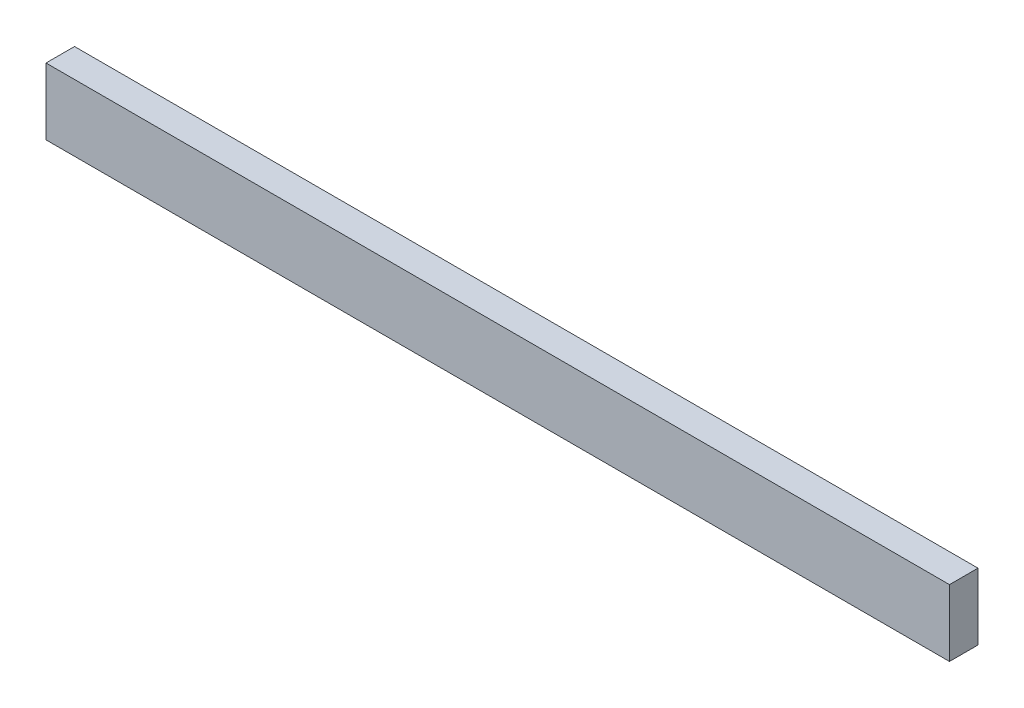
ISO-10303-21;
HEADER;
FILE_DESCRIPTION(('STEP AP214'),'2;1');
FILE_NAME('part.step','',(''),(''),'','','');
FILE_SCHEMA(('AUTOMOTIVE_DESIGN { 1 0 10303 214 1 1 1 1 }'));
ENDSEC;
DATA;
#1=APPLICATION_CONTEXT('core data for automotive mechanical design processes');
#2=APPLICATION_PROTOCOL_DEFINITION('international standard','automotive_design',2000,#1);
#3=PRODUCT_CONTEXT('',#1,'mechanical');
#4=PRODUCT('Part','Part','',(#3));
#5=PRODUCT_RELATED_PRODUCT_CATEGORY('part','',(#4));
#6=PRODUCT_DEFINITION_FORMATION('','',#4);
#7=PRODUCT_DEFINITION_CONTEXT('part definition',#1,'design');
#8=PRODUCT_DEFINITION('design','',#6,#7);
#9=PRODUCT_DEFINITION_SHAPE('','',#8);
#10=(LENGTH_UNIT() NAMED_UNIT(*) SI_UNIT(.MILLI.,.METRE.));
#11=(NAMED_UNIT(*) PLANE_ANGLE_UNIT() SI_UNIT($,.RADIAN.));
#12=(NAMED_UNIT(*) SI_UNIT($,.STERADIAN.) SOLID_ANGLE_UNIT());
#13=UNCERTAINTY_MEASURE_WITH_UNIT(LENGTH_MEASURE(1.E-05),#10,'distance_accuracy_value','');
#14=(GEOMETRIC_REPRESENTATION_CONTEXT(3) GLOBAL_UNCERTAINTY_ASSIGNED_CONTEXT((#13)) GLOBAL_UNIT_ASSIGNED_CONTEXT((#10,
#11,#12)) REPRESENTATION_CONTEXT('',''));
#15=CARTESIAN_POINT('',(0.,0.,0.));
#16=DIRECTION('',(0.,0.,1.));
#17=DIRECTION('',(1.,0.,0.));
#18=AXIS2_PLACEMENT_3D('',#15,#16,#17);
#19=CARTESIAN_POINT('',(0.,0.,6.));
#20=DIRECTION('',(1.,0.,0.));
#21=DIRECTION('',(0.,0.,-1.));
#22=AXIS2_PLACEMENT_3D('',#19,#20,#21);
#23=PLANE('',#22);
#24=DIRECTION('',(0.,-1.,0.));
#25=VECTOR('',#24,1.);
#26=CARTESIAN_POINT('',(0.,0.,0.));
#27=LINE('',#26,#25);
#28=CARTESIAN_POINT('',(0.,14.,0.));
#29=VERTEX_POINT('',#28);
#30=CARTESIAN_POINT('',(0.,0.,0.));
#31=VERTEX_POINT('',#30);
#32=EDGE_CURVE('E99',#29,#31,#27,.T.);
#33=ORIENTED_EDGE('',*,*,#32,.T.);
#34=DIRECTION('',(0.,0.,-1.));
#35=VECTOR('',#34,1.);
#36=CARTESIAN_POINT('',(0.,0.,6.));
#37=LINE('',#36,#35);
#38=CARTESIAN_POINT('',(0.,0.,6.));
#39=VERTEX_POINT('',#38);
#40=EDGE_CURVE('E11',#39,#31,#37,.T.);
#41=ORIENTED_EDGE('',*,*,#40,.F.);
#42=DIRECTION('',(0.,-1.,0.));
#43=VECTOR('',#42,1.);
#44=CARTESIAN_POINT('',(0.,0.,6.));
#45=LINE('',#44,#43);
#46=CARTESIAN_POINT('',(0.,14.,6.));
#47=VERTEX_POINT('',#46);
#48=EDGE_CURVE('E87',#47,#39,#45,.T.);
#49=ORIENTED_EDGE('',*,*,#48,.F.);
#50=DIRECTION('',(0.,0.,-1.));
#51=VECTOR('',#50,1.);
#52=CARTESIAN_POINT('',(0.,14.,6.));
#53=LINE('',#52,#51);
#54=EDGE_CURVE('E95',#47,#29,#53,.T.);
#55=ORIENTED_EDGE('',*,*,#54,.T.);
#56=EDGE_LOOP('',(#33,#41,#49,#55));
#57=FACE_BOUND('',#56,.T.);
#58=ADVANCED_FACE('F36',(#57),#23,.F.);
#59=CARTESIAN_POINT('',(0.,0.,6.));
#60=DIRECTION('',(0.,1.,0.));
#61=DIRECTION('',(0.,0.,1.));
#62=AXIS2_PLACEMENT_3D('',#59,#60,#61);
#63=PLANE('',#62);
#64=DIRECTION('',(1.,0.,0.));
#65=VECTOR('',#64,1.);
#66=CARTESIAN_POINT('',(0.,0.,0.));
#67=LINE('',#66,#65);
#68=CARTESIAN_POINT('',(190.,0.,0.));
#69=VERTEX_POINT('',#68);
#70=EDGE_CURVE('E91',#31,#69,#67,.T.);
#71=ORIENTED_EDGE('',*,*,#70,.T.);
#72=DIRECTION('',(0.,0.,-1.));
#73=VECTOR('',#72,1.);
#74=CARTESIAN_POINT('',(190.,0.,6.));
#75=LINE('',#74,#73);
#76=CARTESIAN_POINT('',(190.,0.,6.));
#77=VERTEX_POINT('',#76);
#78=EDGE_CURVE('E44',#77,#69,#75,.T.);
#79=ORIENTED_EDGE('',*,*,#78,.F.);
#80=DIRECTION('',(1.,0.,0.));
#81=VECTOR('',#80,1.);
#82=CARTESIAN_POINT('',(0.,0.,6.));
#83=LINE('',#82,#81);
#84=EDGE_CURVE('E82',#39,#77,#83,.T.);
#85=ORIENTED_EDGE('',*,*,#84,.F.);
#86=ORIENTED_EDGE('',*,*,#40,.T.);
#87=EDGE_LOOP('',(#71,#79,#85,#86));
#88=FACE_BOUND('',#87,.T.);
#89=ADVANCED_FACE('F90',(#88),#63,.F.);
#90=CARTESIAN_POINT('',(190.,0.,6.));
#91=DIRECTION('',(-1.,0.,0.));
#92=DIRECTION('',(0.,0.,1.));
#93=AXIS2_PLACEMENT_3D('',#90,#91,#92);
#94=PLANE('',#93);
#95=DIRECTION('',(0.,1.,0.));
#96=VECTOR('',#95,1.);
#97=CARTESIAN_POINT('',(190.,0.,0.));
#98=LINE('',#97,#96);
#99=CARTESIAN_POINT('',(190.,14.,0.));
#100=VERTEX_POINT('',#99);
#101=EDGE_CURVE('E69',#69,#100,#98,.T.);
#102=ORIENTED_EDGE('',*,*,#101,.T.);
#103=DIRECTION('',(0.,0.,-1.));
#104=VECTOR('',#103,1.);
#105=CARTESIAN_POINT('',(190.,14.,6.));
#106=LINE('',#105,#104);
#107=CARTESIAN_POINT('',(190.,14.,6.));
#108=VERTEX_POINT('',#107);
#109=EDGE_CURVE('E92',#108,#100,#106,.T.);
#110=ORIENTED_EDGE('',*,*,#109,.F.);
#111=DIRECTION('',(0.,1.,0.));
#112=VECTOR('',#111,1.);
#113=CARTESIAN_POINT('',(190.,0.,6.));
#114=LINE('',#113,#112);
#115=EDGE_CURVE('E85',#77,#108,#114,.T.);
#116=ORIENTED_EDGE('',*,*,#115,.F.);
#117=ORIENTED_EDGE('',*,*,#78,.T.);
#118=EDGE_LOOP('',(#102,#110,#116,#117));
#119=FACE_BOUND('',#118,.T.);
#120=ADVANCED_FACE('F93',(#119),#94,.F.);
#121=CARTESIAN_POINT('',(0.,14.,6.));
#122=DIRECTION('',(0.,-1.,0.));
#123=DIRECTION('',(0.,0.,-1.));
#124=AXIS2_PLACEMENT_3D('',#121,#122,#123);
#125=PLANE('',#124);
#126=DIRECTION('',(-1.,0.,0.));
#127=VECTOR('',#126,1.);
#128=CARTESIAN_POINT('',(0.,14.,0.));
#129=LINE('',#128,#127);
#130=EDGE_CURVE('E75',#100,#29,#129,.T.);
#131=ORIENTED_EDGE('',*,*,#130,.T.);
#132=ORIENTED_EDGE('',*,*,#54,.F.);
#133=DIRECTION('',(-1.,0.,0.));
#134=VECTOR('',#133,1.);
#135=CARTESIAN_POINT('',(0.,14.,6.));
#136=LINE('',#135,#134);
#137=EDGE_CURVE('E52',#108,#47,#136,.T.);
#138=ORIENTED_EDGE('',*,*,#137,.F.);
#139=ORIENTED_EDGE('',*,*,#109,.T.);
#140=EDGE_LOOP('',(#131,#132,#138,#139));
#141=FACE_BOUND('',#140,.T.);
#142=ADVANCED_FACE('F106',(#141),#125,.F.);
#143=CARTESIAN_POINT('',(0.,0.,6.));
#144=DIRECTION('',(0.,0.,-1.));
#145=DIRECTION('',(-1.,0.,0.));
#146=AXIS2_PLACEMENT_3D('',#143,#144,#145);
#147=PLANE('',#146);
#148=ORIENTED_EDGE('',*,*,#48,.T.);
#149=ORIENTED_EDGE('',*,*,#84,.T.);
#150=ORIENTED_EDGE('',*,*,#115,.T.);
#151=ORIENTED_EDGE('',*,*,#137,.T.);
#152=EDGE_LOOP('',(#148,#149,#150,#151));
#153=FACE_BOUND('',#152,.T.);
#154=ADVANCED_FACE('F83',(#153),#147,.F.);
#155=CARTESIAN_POINT('',(0.,0.,0.));
#156=DIRECTION('',(0.,0.,-1.));
#157=DIRECTION('',(-1.,0.,0.));
#158=AXIS2_PLACEMENT_3D('',#155,#156,#157);
#159=PLANE('',#158);
#160=ORIENTED_EDGE('',*,*,#32,.F.);
#161=ORIENTED_EDGE('',*,*,#130,.F.);
#162=ORIENTED_EDGE('',*,*,#101,.F.);
#163=ORIENTED_EDGE('',*,*,#70,.F.);
#164=EDGE_LOOP('',(#160,#161,#162,#163));
#165=FACE_BOUND('',#164,.T.);
#166=ADVANCED_FACE('F109',(#165),#159,.T.);
#167=CLOSED_SHELL('',(#58,#89,#120,#142,#154,#166));
#168=MANIFOLD_SOLID_BREP('B2',#167);
#169=ADVANCED_BREP_SHAPE_REPRESENTATION('',(#18,#168),#14);
#170=SHAPE_DEFINITION_REPRESENTATION(#9,#169);
ENDSEC;
END-ISO-10303-21;
